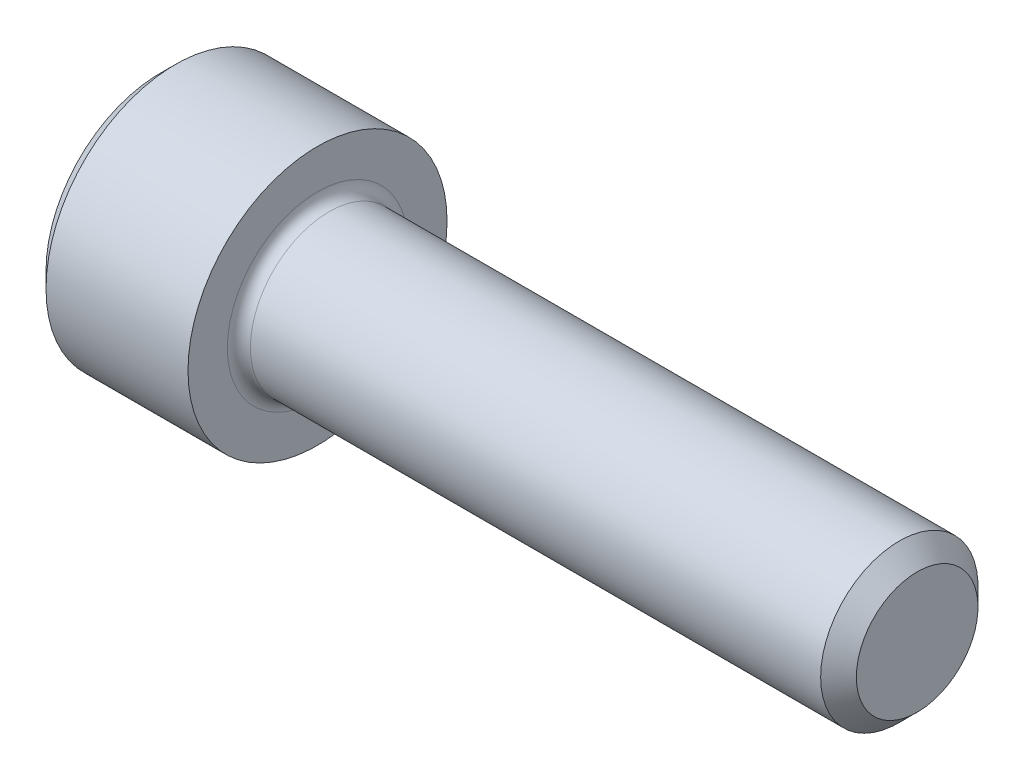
ISO-10303-21;
HEADER;
FILE_DESCRIPTION(('STEP AP214'),'2;1');
FILE_NAME('part.step','',(''),(''),'','','');
FILE_SCHEMA(('AUTOMOTIVE_DESIGN { 1 0 10303 214 1 1 1 1 }'));
ENDSEC;
DATA;
#1=APPLICATION_CONTEXT('core data for automotive mechanical design processes');
#2=APPLICATION_PROTOCOL_DEFINITION('international standard','automotive_design',2000,#1);
#3=PRODUCT_CONTEXT('',#1,'mechanical');
#4=PRODUCT('Part','Part','',(#3));
#5=PRODUCT_RELATED_PRODUCT_CATEGORY('part','',(#4));
#6=PRODUCT_DEFINITION_FORMATION('','',#4);
#7=PRODUCT_DEFINITION_CONTEXT('part definition',#1,'design');
#8=PRODUCT_DEFINITION('design','',#6,#7);
#9=PRODUCT_DEFINITION_SHAPE('','',#8);
#10=(LENGTH_UNIT() NAMED_UNIT(*) SI_UNIT(.MILLI.,.METRE.));
#11=(NAMED_UNIT(*) PLANE_ANGLE_UNIT() SI_UNIT($,.RADIAN.));
#12=(NAMED_UNIT(*) SI_UNIT($,.STERADIAN.) SOLID_ANGLE_UNIT());
#13=UNCERTAINTY_MEASURE_WITH_UNIT(LENGTH_MEASURE(1.E-05),#10,'distance_accuracy_value','');
#14=(GEOMETRIC_REPRESENTATION_CONTEXT(3) GLOBAL_UNCERTAINTY_ASSIGNED_CONTEXT((#13)) GLOBAL_UNIT_ASSIGNED_CONTEXT((#10,
#11,#12)) REPRESENTATION_CONTEXT('',''));
#15=CARTESIAN_POINT('',(0.,0.,0.));
#16=DIRECTION('',(0.,0.,1.));
#17=DIRECTION('',(1.,0.,0.));
#18=AXIS2_PLACEMENT_3D('',#15,#16,#17);
#19=CARTESIAN_POINT('',(0.,0.,0.));
#20=DIRECTION('',(-1.00000000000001,0.,0.));
#21=DIRECTION('',(0.,0.,0.999999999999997));
#22=AXIS2_PLACEMENT_3D('',#19,#20,#21);
#23=PLANE('',#22);
#24=DIRECTION('',(0.,-0.500000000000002,0.866025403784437));
#25=VECTOR('',#24,1.);
#26=CARTESIAN_POINT('',(0.,2.05305755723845,0.));
#27=LINE('',#26,#25);
#28=CARTESIAN_POINT('',(0.,2.05305755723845,0.));
#29=VERTEX_POINT('',#28);
#30=CARTESIAN_POINT('',(0.,1.0265287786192,1.77800000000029));
#31=VERTEX_POINT('',#30);
#32=EDGE_CURVE('E261',#29,#31,#27,.T.);
#33=ORIENTED_EDGE('',*,*,#32,.T.);
#34=DIRECTION('',(0.,1.00000000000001,0.));
#35=VECTOR('',#34,1.);
#36=CARTESIAN_POINT('',(0.,-1.02652877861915,1.77800000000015));
#37=LINE('',#36,#35);
#38=CARTESIAN_POINT('',(0.,-1.02652877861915,1.77800000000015));
#39=VERTEX_POINT('',#38);
#40=EDGE_CURVE('E132',#39,#31,#37,.T.);
#41=ORIENTED_EDGE('',*,*,#40,.F.);
#42=DIRECTION('',(0.,-0.500000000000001,-0.866025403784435));
#43=VECTOR('',#42,1.);
#44=CARTESIAN_POINT('',(0.,-1.02652877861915,1.77800000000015));
#45=LINE('',#44,#43);
#46=CARTESIAN_POINT('',(0.,-2.05305755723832,3.12250225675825E-13));
#47=VERTEX_POINT('',#46);
#48=EDGE_CURVE('E264',#39,#47,#45,.T.);
#49=ORIENTED_EDGE('',*,*,#48,.T.);
#50=DIRECTION('',(0.,0.500000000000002,-0.866025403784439));
#51=VECTOR('',#50,1.);
#52=CARTESIAN_POINT('',(0.,-2.05305755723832,3.12250225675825E-13));
#53=LINE('',#52,#51);
#54=CARTESIAN_POINT('',(0.,-1.02652877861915,-1.77799999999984));
#55=VERTEX_POINT('',#54);
#56=EDGE_CURVE('E267',#47,#55,#53,.T.);
#57=ORIENTED_EDGE('',*,*,#56,.T.);
#58=DIRECTION('',(0.,-1.,0.));
#59=VECTOR('',#58,1.);
#60=CARTESIAN_POINT('',(0.,1.02652877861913,-1.77799999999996));
#61=LINE('',#60,#59);
#62=CARTESIAN_POINT('',(0.,1.02652877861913,-1.77799999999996));
#63=VERTEX_POINT('',#62);
#64=EDGE_CURVE('E270',#63,#55,#61,.T.);
#65=ORIENTED_EDGE('',*,*,#64,.F.);
#66=DIRECTION('',(0.,-0.500000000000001,-0.866025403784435));
#67=VECTOR('',#66,1.);
#68=CARTESIAN_POINT('',(0.,2.05305755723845,0.));
#69=LINE('',#68,#67);
#70=EDGE_CURVE('E127',#29,#63,#69,.T.);
#71=ORIENTED_EDGE('',*,*,#70,.F.);
#72=EDGE_LOOP('',(#33,#41,#49,#57,#65,#71));
#73=FACE_BOUND('',#72,.T.);
#74=CARTESIAN_POINT('',(0.,0.,0.));
#75=DIRECTION('',(-1.00000000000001,0.,0.));
#76=DIRECTION('',(0.,0.,0.999999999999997));
#77=AXIS2_PLACEMENT_3D('',#74,#75,#76);
#78=CIRCLE('',#77,3.0226);
#79=CARTESIAN_POINT('',(0.,0.,3.02259999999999));
#80=VERTEX_POINT('',#79);
#81=EDGE_CURVE('E156',#80,#80,#78,.T.);
#82=ORIENTED_EDGE('',*,*,#81,.T.);
#83=EDGE_LOOP('',(#82));
#84=FACE_BOUND('',#83,.T.);
#85=ADVANCED_FACE('F36',(#73,#84),#23,.T.);
#86=CARTESIAN_POINT('',(0.,0.,0.));
#87=DIRECTION('',(1.00000000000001,0.,0.));
#88=DIRECTION('',(0.,0.,-0.999999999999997));
#89=AXIS2_PLACEMENT_3D('',#86,#87,#88);
#90=CONICAL_SURFACE('',#89,3.0226,0.785398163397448);
#91=CARTESIAN_POINT('',(0.406400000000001,-3.60822483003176E-13,0.));
#92=DIRECTION('',(-1.00000000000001,0.,0.));
#93=DIRECTION('',(0.,0.,0.999999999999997));
#94=AXIS2_PLACEMENT_3D('',#91,#92,#93);
#95=CIRCLE('',#94,3.429);
#96=CARTESIAN_POINT('',(0.406400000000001,-3.68817087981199E-13,3.42899999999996));
#97=VERTEX_POINT('',#96);
#98=EDGE_CURVE('E153',#97,#97,#95,.T.);
#99=ORIENTED_EDGE('',*,*,#98,.T.);
#100=EDGE_LOOP('',(#99));
#101=FACE_BOUND('',#100,.T.);
#102=ORIENTED_EDGE('',*,*,#81,.F.);
#103=EDGE_LOOP('',(#102));
#104=FACE_BOUND('',#103,.T.);
#105=ADVANCED_FACE('F177',(#101,#104),#90,.T.);
#106=CARTESIAN_POINT('',(-31.7500000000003,-1.01307850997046E-12,-1.21430643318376E-13));
#107=DIRECTION('',(-1.00000000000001,0.,0.));
#108=DIRECTION('',(0.,0.,0.999999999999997));
#109=AXIS2_PLACEMENT_3D('',#106,#107,#108);
#110=CYLINDRICAL_SURFACE('',#109,3.429);
#111=CARTESIAN_POINT('',(4.16560000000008,-5.82867087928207E-13,0.));
#112=DIRECTION('',(-1.00000000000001,0.,0.));
#113=DIRECTION('',(0.,0.,0.999999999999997));
#114=AXIS2_PLACEMENT_3D('',#111,#112,#113);
#115=CIRCLE('',#114,3.429);
#116=CARTESIAN_POINT('',(4.16560000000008,-5.9086169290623E-13,3.42899999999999));
#117=VERTEX_POINT('',#116);
#118=EDGE_CURVE('E150',#117,#117,#115,.T.);
#119=ORIENTED_EDGE('',*,*,#118,.T.);
#120=EDGE_LOOP('',(#119));
#121=FACE_BOUND('',#120,.T.);
#122=ORIENTED_EDGE('',*,*,#98,.F.);
#123=EDGE_LOOP('',(#122));
#124=FACE_BOUND('',#123,.T.);
#125=ADVANCED_FACE('F182',(#121,#124),#110,.T.);
#126=CARTESIAN_POINT('',(4.16560000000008,3.42899999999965,1.37043154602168E-13));
#127=DIRECTION('',(1.00000000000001,0.,0.));
#128=DIRECTION('',(0.,0.,-0.999999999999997));
#129=AXIS2_PLACEMENT_3D('',#126,#127,#128);
#130=PLANE('',#129);
#131=CARTESIAN_POINT('',(4.16560000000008,-5.82867087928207E-13,0.));
#132=DIRECTION('',(1.00000000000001,0.,0.));
#133=DIRECTION('',(0.,0.,-0.999999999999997));
#134=AXIS2_PLACEMENT_3D('',#131,#132,#133);
#135=CIRCLE('',#134,2.38759999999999);
#136=CARTESIAN_POINT('',(4.16560000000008,-5.77300474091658E-13,-2.38759999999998));
#137=VERTEX_POINT('',#136);
#138=EDGE_CURVE('E44',#137,#137,#135,.F.);
#139=ORIENTED_EDGE('',*,*,#138,.T.);
#140=EDGE_LOOP('',(#139));
#141=FACE_BOUND('',#140,.T.);
#142=ORIENTED_EDGE('',*,*,#118,.F.);
#143=EDGE_LOOP('',(#142));
#144=FACE_BOUND('',#143,.T.);
#145=ADVANCED_FACE('F161',(#141,#144),#130,.T.);
#146=CARTESIAN_POINT('',(-31.7500000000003,-1.01307850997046E-12,-1.21430643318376E-13));
#147=DIRECTION('',(-1.00000000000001,0.,0.));
#148=DIRECTION('',(0.,0.,0.999999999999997));
#149=AXIS2_PLACEMENT_3D('',#146,#147,#148);
#150=CYLINDRICAL_SURFACE('',#149,2.08279999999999);
#151=CARTESIAN_POINT('',(4.47040000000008,-5.27355936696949E-13,0.));
#152=DIRECTION('',(1.00000000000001,0.,0.));
#153=DIRECTION('',(0.,0.,-0.999999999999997));
#154=AXIS2_PLACEMENT_3D('',#151,#152,#153);
#155=CIRCLE('',#154,2.08279999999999);
#156=CARTESIAN_POINT('',(4.47040000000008,-5.22499954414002E-13,-2.08280000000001));
#157=VERTEX_POINT('',#156);
#158=EDGE_CURVE('E11',#157,#157,#155,.T.);
#159=ORIENTED_EDGE('',*,*,#158,.T.);
#160=EDGE_LOOP('',(#159));
#161=FACE_BOUND('',#160,.T.);
#162=CARTESIAN_POINT('',(19.5681600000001,-4.30211422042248E-13,0.));
#163=DIRECTION('',(-1.00000000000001,0.,0.));
#164=DIRECTION('',(0.,0.,0.999999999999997));
#165=AXIS2_PLACEMENT_3D('',#162,#163,#164);
#166=CIRCLE('',#165,2.08279999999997);
#167=CARTESIAN_POINT('',(19.5681600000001,-4.35067404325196E-13,2.08280000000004));
#168=VERTEX_POINT('',#167);
#169=EDGE_CURVE('E147',#168,#168,#166,.T.);
#170=ORIENTED_EDGE('',*,*,#169,.T.);
#171=EDGE_LOOP('',(#170));
#172=FACE_BOUND('',#171,.T.);
#173=ADVANCED_FACE('F192',(#161,#172),#150,.T.);
#174=CARTESIAN_POINT('',(20.0406000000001,-2.91433543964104E-13,0.));
#175=DIRECTION('',(-1.00000000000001,0.,0.));
#176=DIRECTION('',(0.,0.,0.999999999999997));
#177=AXIS2_PLACEMENT_3D('',#174,#175,#176);
#178=CONICAL_SURFACE('',#177,1.61036,0.785398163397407);
#179=ORIENTED_EDGE('',*,*,#169,.F.);
#180=EDGE_LOOP('',(#179));
#181=FACE_BOUND('',#180,.T.);
#182=CARTESIAN_POINT('',(20.0406000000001,-2.91433543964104E-13,0.));
#183=DIRECTION('',(-1.00000000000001,0.,0.));
#184=DIRECTION('',(0.,0.,0.999999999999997));
#185=AXIS2_PLACEMENT_3D('',#182,#183,#184);
#186=CIRCLE('',#185,1.61036);
#187=CARTESIAN_POINT('',(20.0406000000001,-2.95188047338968E-13,1.61035999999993));
#188=VERTEX_POINT('',#187);
#189=EDGE_CURVE('E143',#188,#188,#186,.T.);
#190=ORIENTED_EDGE('',*,*,#189,.T.);
#191=EDGE_LOOP('',(#190));
#192=FACE_BOUND('',#191,.T.);
#193=ADVANCED_FACE('F172',(#181,#192),#178,.T.);
#194=CARTESIAN_POINT('',(20.0406000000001,1.61035999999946,1.66533453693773E-13));
#195=DIRECTION('',(1.00000000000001,0.,0.));
#196=DIRECTION('',(0.,0.,-0.999999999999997));
#197=AXIS2_PLACEMENT_3D('',#194,#195,#196);
#198=PLANE('',#197);
#199=ORIENTED_EDGE('',*,*,#189,.F.);
#200=EDGE_LOOP('',(#199));
#201=FACE_BOUND('',#200,.T.);
#202=ADVANCED_FACE('F165',(#201),#198,.T.);
#203=CARTESIAN_POINT('',(4.47040000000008,-5.27355936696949E-13,0.));
#204=DIRECTION('',(1.00000000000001,0.,0.));
#205=DIRECTION('',(0.,0.,-0.999999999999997));
#206=AXIS2_PLACEMENT_3D('',#203,#204,#205);
#207=TOROIDAL_SURFACE('',#206,2.38759999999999,0.3048);
#208=ORIENTED_EDGE('',*,*,#158,.F.);
#209=EDGE_LOOP('',(#208));
#210=FACE_BOUND('',#209,.T.);
#211=ORIENTED_EDGE('',*,*,#138,.F.);
#212=EDGE_LOOP('',(#211));
#213=FACE_BOUND('',#212,.T.);
#214=ADVANCED_FACE('F38',(#210,#213),#207,.F.);
#215=CARTESIAN_POINT('',(1.95580000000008,2.05305755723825,0.));
#216=DIRECTION('',(0.,-0.866025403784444,-0.499999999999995));
#217=DIRECTION('',(0.,0.500000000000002,-0.866025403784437));
#218=AXIS2_PLACEMENT_3D('',#215,#216,#217);
#219=PLANE('',#218);
#220=ORIENTED_EDGE('',*,*,#32,.F.);
#221=DIRECTION('',(-1.00000000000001,0.,0.));
#222=VECTOR('',#221,1.);
#223=CARTESIAN_POINT('',(1.95580000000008,2.05305755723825,0.));
#224=LINE('',#223,#222);
#225=CARTESIAN_POINT('',(1.95580000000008,2.05305755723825,0.));
#226=VERTEX_POINT('',#225);
#227=EDGE_CURVE('E251',#226,#29,#224,.T.);
#228=ORIENTED_EDGE('',*,*,#227,.F.);
#229=DIRECTION('',(0.,-0.500000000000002,0.866025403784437));
#230=VECTOR('',#229,1.);
#231=CARTESIAN_POINT('',(1.95580000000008,2.05305755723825,0.));
#232=LINE('',#231,#230);
#233=CARTESIAN_POINT('',(1.95580000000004,1.53979316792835,0.889000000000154));
#234=VERTEX_POINT('',#233);
#235=EDGE_CURVE('E119',#226,#234,#232,.T.);
#236=ORIENTED_EDGE('',*,*,#235,.T.);
#237=CARTESIAN_POINT('',(1.95580000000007,1.02652877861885,1.77800000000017));
#238=VERTEX_POINT('',#237);
#239=EDGE_CURVE('E110',#234,#238,#232,.T.);
#240=ORIENTED_EDGE('',*,*,#239,.T.);
#241=DIRECTION('',(-1.00000000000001,0.,0.));
#242=VECTOR('',#241,1.);
#243=CARTESIAN_POINT('',(1.95580000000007,1.02652877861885,1.77800000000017));
#244=LINE('',#243,#242);
#245=EDGE_CURVE('E124',#238,#31,#244,.T.);
#246=ORIENTED_EDGE('',*,*,#245,.T.);
#247=EDGE_LOOP('',(#220,#228,#236,#240,#246));
#248=FACE_BOUND('',#247,.T.);
#249=ADVANCED_FACE('F123',(#248),#219,.T.);
#250=CARTESIAN_POINT('',(1.95579999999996,-1.02652877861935,1.77800000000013));
#251=DIRECTION('',(0.,0.,0.999999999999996));
#252=DIRECTION('',(0.,-1.00000000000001,0.));
#253=AXIS2_PLACEMENT_3D('',#250,#251,#252);
#254=PLANE('',#253);
#255=ORIENTED_EDGE('',*,*,#40,.T.);
#256=ORIENTED_EDGE('',*,*,#245,.F.);
#257=DIRECTION('',(0.,1.00000000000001,0.));
#258=VECTOR('',#257,1.);
#259=CARTESIAN_POINT('',(1.95579999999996,-1.02652877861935,1.77800000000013));
#260=LINE('',#259,#258);
#261=CARTESIAN_POINT('',(1.9558,-5.27355936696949E-13,1.77800000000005));
#262=VERTEX_POINT('',#261);
#263=EDGE_CURVE('E107',#262,#238,#260,.T.);
#264=ORIENTED_EDGE('',*,*,#263,.F.);
#265=CARTESIAN_POINT('',(1.95579999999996,-1.02652877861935,1.77800000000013));
#266=VERTEX_POINT('',#265);
#267=EDGE_CURVE('E118',#266,#262,#260,.T.);
#268=ORIENTED_EDGE('',*,*,#267,.F.);
#269=DIRECTION('',(-1.00000000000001,0.,0.));
#270=VECTOR('',#269,1.);
#271=CARTESIAN_POINT('',(1.95579999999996,-1.02652877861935,1.77800000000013));
#272=LINE('',#271,#270);
#273=EDGE_CURVE('E134',#266,#39,#272,.T.);
#274=ORIENTED_EDGE('',*,*,#273,.T.);
#275=EDGE_LOOP('',(#255,#256,#264,#268,#274));
#276=FACE_BOUND('',#275,.T.);
#277=ADVANCED_FACE('F129',(#276),#254,.F.);
#278=CARTESIAN_POINT('',(1.95579999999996,-1.02652877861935,1.77800000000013));
#279=DIRECTION('',(0.,0.866025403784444,-0.499999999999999));
#280=DIRECTION('',(0.,0.500000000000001,0.866025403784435));
#281=AXIS2_PLACEMENT_3D('',#278,#279,#280);
#282=PLANE('',#281);
#283=ORIENTED_EDGE('',*,*,#48,.F.);
#284=ORIENTED_EDGE('',*,*,#273,.F.);
#285=DIRECTION('',(0.,-0.500000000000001,-0.866025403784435));
#286=VECTOR('',#285,1.);
#287=CARTESIAN_POINT('',(1.95579999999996,-1.02652877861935,1.77800000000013));
#288=LINE('',#287,#286);
#289=CARTESIAN_POINT('',(1.95579999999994,-1.53979316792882,0.889000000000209));
#290=VERTEX_POINT('',#289);
#291=EDGE_CURVE('E290',#266,#290,#288,.T.);
#292=ORIENTED_EDGE('',*,*,#291,.T.);
#293=CARTESIAN_POINT('',(1.9558,-2.05305755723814,2.4980018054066E-13));
#294=VERTEX_POINT('',#293);
#295=EDGE_CURVE('E279',#290,#294,#288,.T.);
#296=ORIENTED_EDGE('',*,*,#295,.T.);
#297=DIRECTION('',(-1.00000000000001,0.,0.));
#298=VECTOR('',#297,1.);
#299=CARTESIAN_POINT('',(1.9558,-2.05305755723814,2.4980018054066E-13));
#300=LINE('',#299,#298);
#301=EDGE_CURVE('E139',#294,#47,#300,.T.);
#302=ORIENTED_EDGE('',*,*,#301,.T.);
#303=EDGE_LOOP('',(#283,#284,#292,#296,#302));
#304=FACE_BOUND('',#303,.T.);
#305=ADVANCED_FACE('F205',(#304),#282,.T.);
#306=CARTESIAN_POINT('',(1.9558,-2.05305755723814,2.4980018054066E-13));
#307=DIRECTION('',(0.,0.866025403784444,0.499999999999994));
#308=DIRECTION('',(0.,-0.500000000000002,0.866025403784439));
#309=AXIS2_PLACEMENT_3D('',#306,#307,#308);
#310=PLANE('',#309);
#311=ORIENTED_EDGE('',*,*,#56,.F.);
#312=ORIENTED_EDGE('',*,*,#301,.F.);
#313=DIRECTION('',(0.,0.500000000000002,-0.866025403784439));
#314=VECTOR('',#313,1.);
#315=CARTESIAN_POINT('',(1.9558,-2.05305755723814,2.4980018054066E-13));
#316=LINE('',#315,#314);
#317=CARTESIAN_POINT('',(1.9558,-1.53979316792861,-0.888999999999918));
#318=VERTEX_POINT('',#317);
#319=EDGE_CURVE('E257',#294,#318,#316,.T.);
#320=ORIENTED_EDGE('',*,*,#319,.T.);
#321=CARTESIAN_POINT('',(1.9558,-1.02652877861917,-1.7779999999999));
#322=VERTEX_POINT('',#321);
#323=EDGE_CURVE('E289',#318,#322,#316,.T.);
#324=ORIENTED_EDGE('',*,*,#323,.T.);
#325=DIRECTION('',(-1.00000000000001,0.,0.));
#326=VECTOR('',#325,1.);
#327=CARTESIAN_POINT('',(1.9558,-1.02652877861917,-1.7779999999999));
#328=LINE('',#327,#326);
#329=EDGE_CURVE('E250',#322,#55,#328,.T.);
#330=ORIENTED_EDGE('',*,*,#329,.T.);
#331=EDGE_LOOP('',(#311,#312,#320,#324,#330));
#332=FACE_BOUND('',#331,.T.);
#333=ADVANCED_FACE('F208',(#332),#310,.T.);
#334=CARTESIAN_POINT('',(1.95579999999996,1.02652877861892,-1.77799999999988));
#335=DIRECTION('',(0.,0.,-0.999999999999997));
#336=DIRECTION('',(0.,1.,0.));
#337=AXIS2_PLACEMENT_3D('',#334,#335,#336);
#338=PLANE('',#337);
#339=ORIENTED_EDGE('',*,*,#64,.T.);
#340=ORIENTED_EDGE('',*,*,#329,.F.);
#341=DIRECTION('',(0.,-1.,0.));
#342=VECTOR('',#341,1.);
#343=CARTESIAN_POINT('',(1.95579999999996,1.02652877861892,-1.77799999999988));
#344=LINE('',#343,#342);
#345=CARTESIAN_POINT('',(1.95579999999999,-8.32667268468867E-13,-1.77799999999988));
#346=VERTEX_POINT('',#345);
#347=EDGE_CURVE('E254',#346,#322,#344,.T.);
#348=ORIENTED_EDGE('',*,*,#347,.F.);
#349=CARTESIAN_POINT('',(1.95579999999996,1.02652877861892,-1.77799999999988));
#350=VERTEX_POINT('',#349);
#351=EDGE_CURVE('E51',#350,#346,#344,.T.);
#352=ORIENTED_EDGE('',*,*,#351,.F.);
#353=DIRECTION('',(-1.00000000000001,0.,0.));
#354=VECTOR('',#353,1.);
#355=CARTESIAN_POINT('',(1.95579999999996,1.02652877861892,-1.77799999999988));
#356=LINE('',#355,#354);
#357=EDGE_CURVE('E247',#350,#63,#356,.T.);
#358=ORIENTED_EDGE('',*,*,#357,.T.);
#359=EDGE_LOOP('',(#339,#340,#348,#352,#358));
#360=FACE_BOUND('',#359,.T.);
#361=ADVANCED_FACE('F212',(#360),#338,.F.);
#362=CARTESIAN_POINT('',(1.95580000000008,2.05305755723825,0.));
#363=DIRECTION('',(0.,0.866025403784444,-0.500000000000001));
#364=DIRECTION('',(0.,0.500000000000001,0.866025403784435));
#365=AXIS2_PLACEMENT_3D('',#362,#363,#364);
#366=PLANE('',#365);
#367=ORIENTED_EDGE('',*,*,#70,.T.);
#368=ORIENTED_EDGE('',*,*,#357,.F.);
#369=DIRECTION('',(0.,-0.500000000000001,-0.866025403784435));
#370=VECTOR('',#369,1.);
#371=CARTESIAN_POINT('',(1.95580000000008,2.05305755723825,0.));
#372=LINE('',#371,#370);
#373=CARTESIAN_POINT('',(1.95580000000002,1.53979316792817,-0.888999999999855));
#374=VERTEX_POINT('',#373);
#375=EDGE_CURVE('E237',#374,#350,#372,.T.);
#376=ORIENTED_EDGE('',*,*,#375,.F.);
#377=EDGE_CURVE('E243',#226,#374,#372,.T.);
#378=ORIENTED_EDGE('',*,*,#377,.F.);
#379=ORIENTED_EDGE('',*,*,#227,.T.);
#380=EDGE_LOOP('',(#367,#368,#376,#378,#379));
#381=FACE_BOUND('',#380,.T.);
#382=ADVANCED_FACE('F216',(#381),#366,.F.);
#383=CARTESIAN_POINT('',(1.9558,3.07958633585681,-1.77799999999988));
#384=DIRECTION('',(1.00000000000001,0.,0.));
#385=DIRECTION('',(0.,0.,-0.999999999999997));
#386=AXIS2_PLACEMENT_3D('',#383,#384,#385);
#387=PLANE('',#386);
#388=ORIENTED_EDGE('',*,*,#347,.T.);
#389=ORIENTED_EDGE('',*,*,#323,.F.);
#390=CARTESIAN_POINT('',(1.9558,-4.16333634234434E-13,0.));
#391=DIRECTION('',(-1.00000000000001,0.,0.));
#392=DIRECTION('',(0.,0.,0.999999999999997));
#393=AXIS2_PLACEMENT_3D('',#390,#391,#392);
#394=CIRCLE('',#393,1.778);
#395=EDGE_CURVE('E285',#346,#318,#394,.T.);
#396=ORIENTED_EDGE('',*,*,#395,.F.);
#397=EDGE_LOOP('',(#388,#389,#396));
#398=FACE_BOUND('',#397,.T.);
#399=ADVANCED_FACE('F220',(#398),#387,.F.);
#400=ORIENTED_EDGE('',*,*,#319,.F.);
#401=ORIENTED_EDGE('',*,*,#295,.F.);
#402=EDGE_CURVE('E137',#318,#290,#394,.T.);
#403=ORIENTED_EDGE('',*,*,#402,.F.);
#404=EDGE_LOOP('',(#400,#401,#403));
#405=FACE_BOUND('',#404,.T.);
#406=ADVANCED_FACE('F223',(#405),#387,.F.);
#407=ORIENTED_EDGE('',*,*,#291,.F.);
#408=ORIENTED_EDGE('',*,*,#267,.T.);
#409=EDGE_CURVE('E133',#290,#262,#394,.T.);
#410=ORIENTED_EDGE('',*,*,#409,.F.);
#411=EDGE_LOOP('',(#407,#408,#410));
#412=FACE_BOUND('',#411,.T.);
#413=ADVANCED_FACE('F228',(#412),#387,.F.);
#414=ORIENTED_EDGE('',*,*,#263,.T.);
#415=ORIENTED_EDGE('',*,*,#239,.F.);
#416=EDGE_CURVE('E113',#262,#234,#394,.T.);
#417=ORIENTED_EDGE('',*,*,#416,.F.);
#418=EDGE_LOOP('',(#414,#415,#417));
#419=FACE_BOUND('',#418,.T.);
#420=ADVANCED_FACE('F109',(#419),#387,.F.);
#421=ORIENTED_EDGE('',*,*,#235,.F.);
#422=ORIENTED_EDGE('',*,*,#377,.T.);
#423=EDGE_CURVE('E144',#234,#374,#394,.T.);
#424=ORIENTED_EDGE('',*,*,#423,.F.);
#425=EDGE_LOOP('',(#421,#422,#424));
#426=FACE_BOUND('',#425,.T.);
#427=ADVANCED_FACE('F231',(#426),#387,.F.);
#428=ORIENTED_EDGE('',*,*,#375,.T.);
#429=ORIENTED_EDGE('',*,*,#351,.T.);
#430=EDGE_CURVE('E240',#374,#346,#394,.T.);
#431=ORIENTED_EDGE('',*,*,#430,.F.);
#432=EDGE_LOOP('',(#428,#429,#431));
#433=FACE_BOUND('',#432,.T.);
#434=ADVANCED_FACE('F201',(#433),#387,.F.);
#435=CARTESIAN_POINT('',(1.9558,-4.16333634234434E-13,0.));
#436=DIRECTION('',(-1.00000000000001,0.,0.));
#437=DIRECTION('',(0.,0.,0.999999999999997));
#438=AXIS2_PLACEMENT_3D('',#435,#436,#437);
#439=CONICAL_SURFACE('',#438,1.778,1.04719755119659);
#440=CARTESIAN_POINT('',(2.98232877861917,-3.60822483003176E-13,0.));
#441=VERTEX_POINT('',#440);
#442=VERTEX_LOOP('',#441);
#443=FACE_BOUND('',#442,.T.);
#444=ORIENTED_EDGE('',*,*,#416,.T.);
#445=ORIENTED_EDGE('',*,*,#423,.T.);
#446=ORIENTED_EDGE('',*,*,#430,.T.);
#447=ORIENTED_EDGE('',*,*,#395,.T.);
#448=ORIENTED_EDGE('',*,*,#402,.T.);
#449=ORIENTED_EDGE('',*,*,#409,.T.);
#450=EDGE_LOOP('',(#444,#445,#446,#447,#448,#449));
#451=FACE_BOUND('',#450,.T.);
#452=ADVANCED_FACE('F199',(#443,#451),#439,.F.);
#453=CLOSED_SHELL('',(#85,#105,#125,#145,#173,#193,#202,#214,#249,#277,#305,#333,#361,#382,#399,
#406,#413,#420,#427,#434,#452));
#454=MANIFOLD_SOLID_BREP('B2',#453);
#455=ADVANCED_BREP_SHAPE_REPRESENTATION('',(#18,#454),#14);
#456=SHAPE_DEFINITION_REPRESENTATION(#9,#455);
ENDSEC;
END-ISO-10303-21;
